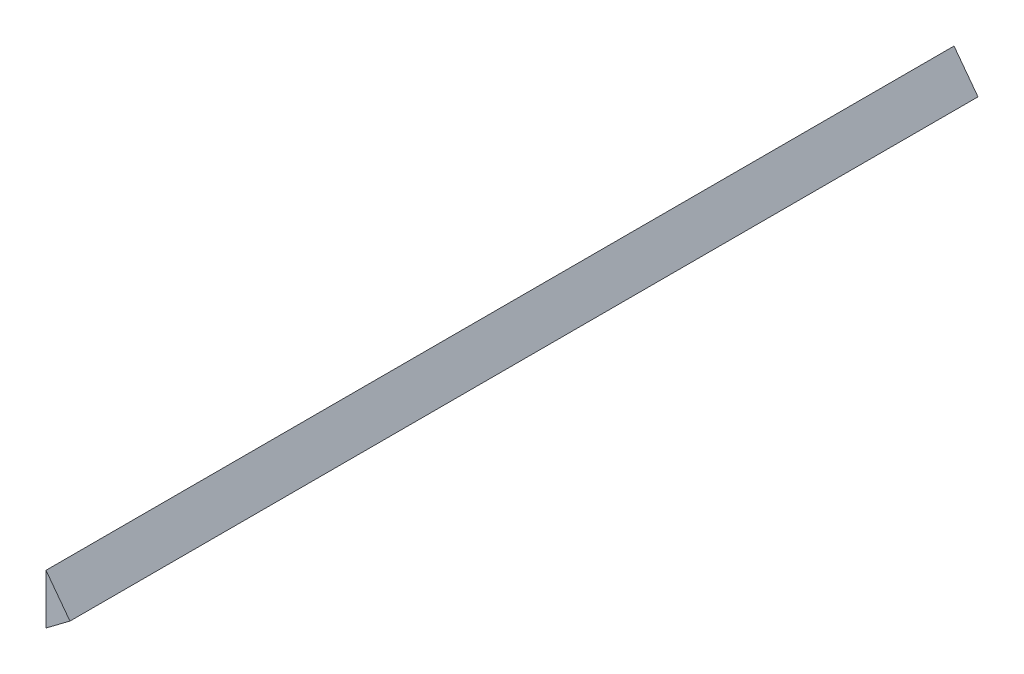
from build123d import *

# Parameters (mm, degrees)
BOSS_EXTRUDE1_DEPTH = 1155.7


with BuildPart() as part:
    # Sketch1 → Boss-Extrude1 (new body)
    with BuildSketch(Plane.XY):
        Polygon((0, -2290.446497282), (30.505965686, -2267.621159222), (0, -2226.850067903), align=None)
    extrude(amount=-BOSS_EXTRUDE1_DEPTH)


solid = part.part
